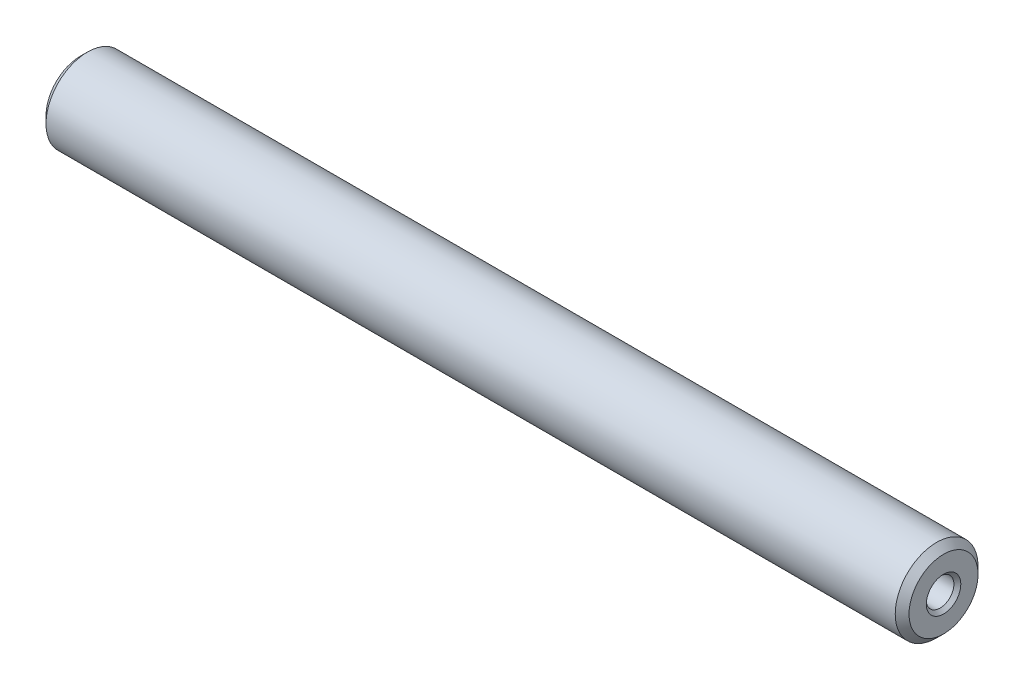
ISO-10303-21;
HEADER;
FILE_DESCRIPTION(('STEP AP214'),'2;1');
FILE_NAME('part.step','',(''),(''),'','','');
FILE_SCHEMA(('AUTOMOTIVE_DESIGN { 1 0 10303 214 1 1 1 1 }'));
ENDSEC;
DATA;
#1=APPLICATION_CONTEXT('core data for automotive mechanical design processes');
#2=APPLICATION_PROTOCOL_DEFINITION('international standard','automotive_design',2000,#1);
#3=PRODUCT_CONTEXT('',#1,'mechanical');
#4=PRODUCT('Part','Part','',(#3));
#5=PRODUCT_RELATED_PRODUCT_CATEGORY('part','',(#4));
#6=PRODUCT_DEFINITION_FORMATION('','',#4);
#7=PRODUCT_DEFINITION_CONTEXT('part definition',#1,'design');
#8=PRODUCT_DEFINITION('design','',#6,#7);
#9=PRODUCT_DEFINITION_SHAPE('','',#8);
#10=(LENGTH_UNIT() NAMED_UNIT(*) SI_UNIT(.MILLI.,.METRE.));
#11=(NAMED_UNIT(*) PLANE_ANGLE_UNIT() SI_UNIT($,.RADIAN.));
#12=(NAMED_UNIT(*) SI_UNIT($,.STERADIAN.) SOLID_ANGLE_UNIT());
#13=UNCERTAINTY_MEASURE_WITH_UNIT(LENGTH_MEASURE(1.E-05),#10,'distance_accuracy_value','');
#14=(GEOMETRIC_REPRESENTATION_CONTEXT(3) GLOBAL_UNCERTAINTY_ASSIGNED_CONTEXT((#13)) GLOBAL_UNIT_ASSIGNED_CONTEXT((#10,
#11,#12)) REPRESENTATION_CONTEXT('',''));
#15=CARTESIAN_POINT('',(0.,0.,0.));
#16=DIRECTION('',(0.,0.,1.));
#17=DIRECTION('',(1.,0.,0.));
#18=AXIS2_PLACEMENT_3D('',#15,#16,#17);
#19=CARTESIAN_POINT('',(-62.5,0.,0.));
#20=DIRECTION('',(1.,0.,0.));
#21=DIRECTION('',(0.,0.,-1.));
#22=AXIS2_PLACEMENT_3D('',#19,#20,#21);
#23=PLANE('',#22);
#24=CARTESIAN_POINT('',(-62.5,0.,0.));
#25=DIRECTION('',(-1.,0.,0.));
#26=DIRECTION('',(0.,0.,1.));
#27=AXIS2_PLACEMENT_3D('',#24,#25,#26);
#28=CIRCLE('',#27,2.5);
#29=CARTESIAN_POINT('',(-62.5,0.,2.5));
#30=VERTEX_POINT('',#29);
#31=EDGE_CURVE('E56',#30,#30,#28,.T.);
#32=ORIENTED_EDGE('',*,*,#31,.F.);
#33=EDGE_LOOP('',(#32));
#34=FACE_BOUND('',#33,.T.);
#35=CARTESIAN_POINT('',(-62.5,0.,0.));
#36=DIRECTION('',(1.,0.,0.));
#37=DIRECTION('',(0.,0.,-1.));
#38=AXIS2_PLACEMENT_3D('',#35,#36,#37);
#39=CIRCLE('',#38,4.99999999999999);
#40=CARTESIAN_POINT('',(-62.5,0.,-4.99999999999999));
#41=VERTEX_POINT('',#40);
#42=EDGE_CURVE('E11',#41,#41,#39,.F.);
#43=ORIENTED_EDGE('',*,*,#42,.T.);
#44=EDGE_LOOP('',(#43));
#45=FACE_BOUND('',#44,.T.);
#46=ADVANCED_FACE('F33',(#34,#45),#23,.F.);
#47=CARTESIAN_POINT('',(-35.6829716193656,0.,0.));
#48=DIRECTION('',(-1.,0.,0.));
#49=DIRECTION('',(0.,0.,1.));
#50=AXIS2_PLACEMENT_3D('',#47,#48,#49);
#51=CYLINDRICAL_SURFACE('',#50,6.);
#52=CARTESIAN_POINT('',(61.5,0.,0.));
#53=DIRECTION('',(-1.,0.,0.));
#54=DIRECTION('',(0.,0.,1.));
#55=AXIS2_PLACEMENT_3D('',#52,#53,#54);
#56=CIRCLE('',#55,6.);
#57=CARTESIAN_POINT('',(61.5,0.,6.));
#58=VERTEX_POINT('',#57);
#59=EDGE_CURVE('E75',#58,#58,#56,.T.);
#60=ORIENTED_EDGE('',*,*,#59,.T.);
#61=EDGE_LOOP('',(#60));
#62=FACE_BOUND('',#61,.T.);
#63=CARTESIAN_POINT('',(-61.5,0.,0.));
#64=DIRECTION('',(1.,0.,0.));
#65=DIRECTION('',(0.,0.,-1.));
#66=AXIS2_PLACEMENT_3D('',#63,#64,#65);
#67=CIRCLE('',#66,6.);
#68=CARTESIAN_POINT('',(-61.5,0.,-6.));
#69=VERTEX_POINT('',#68);
#70=EDGE_CURVE('E72',#69,#69,#67,.T.);
#71=ORIENTED_EDGE('',*,*,#70,.T.);
#72=EDGE_LOOP('',(#71));
#73=FACE_BOUND('',#72,.T.);
#74=ADVANCED_FACE('F89',(#62,#73),#51,.T.);
#75=CARTESIAN_POINT('',(62.5,6.,0.));
#76=DIRECTION('',(-1.,0.,0.));
#77=DIRECTION('',(0.,0.,1.));
#78=AXIS2_PLACEMENT_3D('',#75,#76,#77);
#79=PLANE('',#78);
#80=CARTESIAN_POINT('',(62.5,0.,0.));
#81=DIRECTION('',(1.,0.,0.));
#82=DIRECTION('',(0.,0.,-1.));
#83=AXIS2_PLACEMENT_3D('',#80,#81,#82);
#84=CIRCLE('',#83,2.5);
#85=CARTESIAN_POINT('',(62.5,0.,-2.5));
#86=VERTEX_POINT('',#85);
#87=EDGE_CURVE('E63',#86,#86,#84,.T.);
#88=ORIENTED_EDGE('',*,*,#87,.F.);
#89=EDGE_LOOP('',(#88));
#90=FACE_BOUND('',#89,.T.);
#91=CARTESIAN_POINT('',(62.5,0.,0.));
#92=DIRECTION('',(-1.,0.,0.));
#93=DIRECTION('',(0.,0.,1.));
#94=AXIS2_PLACEMENT_3D('',#91,#92,#93);
#95=CIRCLE('',#94,5.00000000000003);
#96=CARTESIAN_POINT('',(62.5,0.,5.00000000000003));
#97=VERTEX_POINT('',#96);
#98=EDGE_CURVE('E40',#97,#97,#95,.F.);
#99=ORIENTED_EDGE('',*,*,#98,.T.);
#100=EDGE_LOOP('',(#99));
#101=FACE_BOUND('',#100,.T.);
#102=ADVANCED_FACE('F80',(#90,#101),#79,.F.);
#103=CARTESIAN_POINT('',(61.5,0.,0.));
#104=DIRECTION('',(-1.,0.,0.));
#105=DIRECTION('',(0.,0.,1.));
#106=AXIS2_PLACEMENT_3D('',#103,#104,#105);
#107=CONICAL_SURFACE('',#106,6.,0.785398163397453);
#108=ORIENTED_EDGE('',*,*,#98,.F.);
#109=EDGE_LOOP('',(#108));
#110=FACE_BOUND('',#109,.T.);
#111=ORIENTED_EDGE('',*,*,#59,.F.);
#112=EDGE_LOOP('',(#111));
#113=FACE_BOUND('',#112,.T.);
#114=ADVANCED_FACE('F82',(#110,#113),#107,.T.);
#115=CARTESIAN_POINT('',(-62.5,0.,0.));
#116=DIRECTION('',(1.,0.,0.));
#117=DIRECTION('',(0.,0.,-1.));
#118=AXIS2_PLACEMENT_3D('',#115,#116,#117);
#119=CONICAL_SURFACE('',#118,4.99999999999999,0.785398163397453);
#120=ORIENTED_EDGE('',*,*,#70,.F.);
#121=EDGE_LOOP('',(#120));
#122=FACE_BOUND('',#121,.T.);
#123=ORIENTED_EDGE('',*,*,#42,.F.);
#124=EDGE_LOOP('',(#123));
#125=FACE_BOUND('',#124,.T.);
#126=ADVANCED_FACE('F85',(#122,#125),#119,.T.);
#127=CARTESIAN_POINT('',(-51.5,0.,0.));
#128=DIRECTION('',(-1.,0.,0.));
#129=DIRECTION('',(0.,0.,1.));
#130=AXIS2_PLACEMENT_3D('',#127,#128,#129);
#131=CONICAL_SURFACE('',#130,1.99999999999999,1.02974425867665);
#132=CARTESIAN_POINT('',(-50.2982787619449,0.,0.));
#133=VERTEX_POINT('',#132);
#134=VERTEX_LOOP('',#133);
#135=FACE_BOUND('',#134,.T.);
#136=CARTESIAN_POINT('',(-51.5,0.,0.));
#137=DIRECTION('',(-1.,0.,0.));
#138=DIRECTION('',(0.,0.,1.));
#139=AXIS2_PLACEMENT_3D('',#136,#137,#138);
#140=CIRCLE('',#139,1.99999999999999);
#141=CARTESIAN_POINT('',(-51.5,0.,1.99999999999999));
#142=VERTEX_POINT('',#141);
#143=EDGE_CURVE('E69',#142,#142,#140,.T.);
#144=ORIENTED_EDGE('',*,*,#143,.T.);
#145=EDGE_LOOP('',(#144));
#146=FACE_BOUND('',#145,.T.);
#147=ADVANCED_FACE('F96',(#135,#146),#131,.F.);
#148=CARTESIAN_POINT('',(-62.5,0.,0.));
#149=DIRECTION('',(-1.,0.,0.));
#150=DIRECTION('',(0.,0.,1.));
#151=AXIS2_PLACEMENT_3D('',#148,#149,#150);
#152=CYLINDRICAL_SURFACE('',#151,1.99999999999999);
#153=ORIENTED_EDGE('',*,*,#143,.F.);
#154=EDGE_LOOP('',(#153));
#155=FACE_BOUND('',#154,.T.);
#156=CARTESIAN_POINT('',(-62.,0.,0.));
#157=DIRECTION('',(-1.,0.,0.));
#158=DIRECTION('',(0.,0.,1.));
#159=AXIS2_PLACEMENT_3D('',#156,#157,#158);
#160=CIRCLE('',#159,2.);
#161=CARTESIAN_POINT('',(-62.,0.,2.));
#162=VERTEX_POINT('',#161);
#163=EDGE_CURVE('E60',#162,#162,#160,.T.);
#164=ORIENTED_EDGE('',*,*,#163,.T.);
#165=EDGE_LOOP('',(#164));
#166=FACE_BOUND('',#165,.T.);
#167=ADVANCED_FACE('F107',(#155,#166),#152,.F.);
#168=CARTESIAN_POINT('',(-62.5,0.,0.));
#169=DIRECTION('',(-1.,0.,0.));
#170=DIRECTION('',(0.,0.,1.));
#171=AXIS2_PLACEMENT_3D('',#168,#169,#170);
#172=CONICAL_SURFACE('',#171,2.5,0.785398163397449);
#173=ORIENTED_EDGE('',*,*,#163,.F.);
#174=EDGE_LOOP('',(#173));
#175=FACE_BOUND('',#174,.T.);
#176=ORIENTED_EDGE('',*,*,#31,.T.);
#177=EDGE_LOOP('',(#176));
#178=FACE_BOUND('',#177,.T.);
#179=ADVANCED_FACE('F50',(#175,#178),#172,.F.);
#180=CARTESIAN_POINT('',(51.5,0.,0.));
#181=DIRECTION('',(1.,0.,0.));
#182=DIRECTION('',(0.,0.,-1.));
#183=AXIS2_PLACEMENT_3D('',#180,#181,#182);
#184=CONICAL_SURFACE('',#183,1.99999999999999,1.02974425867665);
#185=CARTESIAN_POINT('',(50.2982787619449,0.,0.));
#186=VERTEX_POINT('',#185);
#187=VERTEX_LOOP('',#186);
#188=FACE_BOUND('',#187,.T.);
#189=CARTESIAN_POINT('',(51.5,0.,0.));
#190=DIRECTION('',(1.,0.,0.));
#191=DIRECTION('',(0.,0.,-1.));
#192=AXIS2_PLACEMENT_3D('',#189,#190,#191);
#193=CIRCLE('',#192,1.99999999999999);
#194=CARTESIAN_POINT('',(51.5,0.,-1.99999999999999));
#195=VERTEX_POINT('',#194);
#196=EDGE_CURVE('E54',#195,#195,#193,.T.);
#197=ORIENTED_EDGE('',*,*,#196,.T.);
#198=EDGE_LOOP('',(#197));
#199=FACE_BOUND('',#198,.T.);
#200=ADVANCED_FACE('F46',(#188,#199),#184,.F.);
#201=CARTESIAN_POINT('',(62.5,0.,0.));
#202=DIRECTION('',(1.,0.,0.));
#203=DIRECTION('',(0.,0.,-1.));
#204=AXIS2_PLACEMENT_3D('',#201,#202,#203);
#205=CYLINDRICAL_SURFACE('',#204,1.99999999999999);
#206=ORIENTED_EDGE('',*,*,#196,.F.);
#207=EDGE_LOOP('',(#206));
#208=FACE_BOUND('',#207,.T.);
#209=CARTESIAN_POINT('',(62.,0.,0.));
#210=DIRECTION('',(1.,0.,0.));
#211=DIRECTION('',(0.,0.,-1.));
#212=AXIS2_PLACEMENT_3D('',#209,#210,#211);
#213=CIRCLE('',#212,2.);
#214=CARTESIAN_POINT('',(62.,0.,-2.));
#215=VERTEX_POINT('',#214);
#216=EDGE_CURVE('E57',#215,#215,#213,.T.);
#217=ORIENTED_EDGE('',*,*,#216,.T.);
#218=EDGE_LOOP('',(#217));
#219=FACE_BOUND('',#218,.T.);
#220=ADVANCED_FACE('F49',(#208,#219),#205,.F.);
#221=CARTESIAN_POINT('',(62.5,0.,0.));
#222=DIRECTION('',(1.,0.,0.));
#223=DIRECTION('',(0.,0.,-1.));
#224=AXIS2_PLACEMENT_3D('',#221,#222,#223);
#225=CONICAL_SURFACE('',#224,2.5,0.785398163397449);
#226=ORIENTED_EDGE('',*,*,#216,.F.);
#227=EDGE_LOOP('',(#226));
#228=FACE_BOUND('',#227,.T.);
#229=ORIENTED_EDGE('',*,*,#87,.T.);
#230=EDGE_LOOP('',(#229));
#231=FACE_BOUND('',#230,.T.);
#232=ADVANCED_FACE('F127',(#228,#231),#225,.F.);
#233=CLOSED_SHELL('',(#46,#74,#102,#114,#126,#147,#167,#179,#200,#220,#232));
#234=MANIFOLD_SOLID_BREP('B2',#233);
#235=ADVANCED_BREP_SHAPE_REPRESENTATION('',(#18,#234),#14);
#236=SHAPE_DEFINITION_REPRESENTATION(#9,#235);
ENDSEC;
END-ISO-10303-21;
